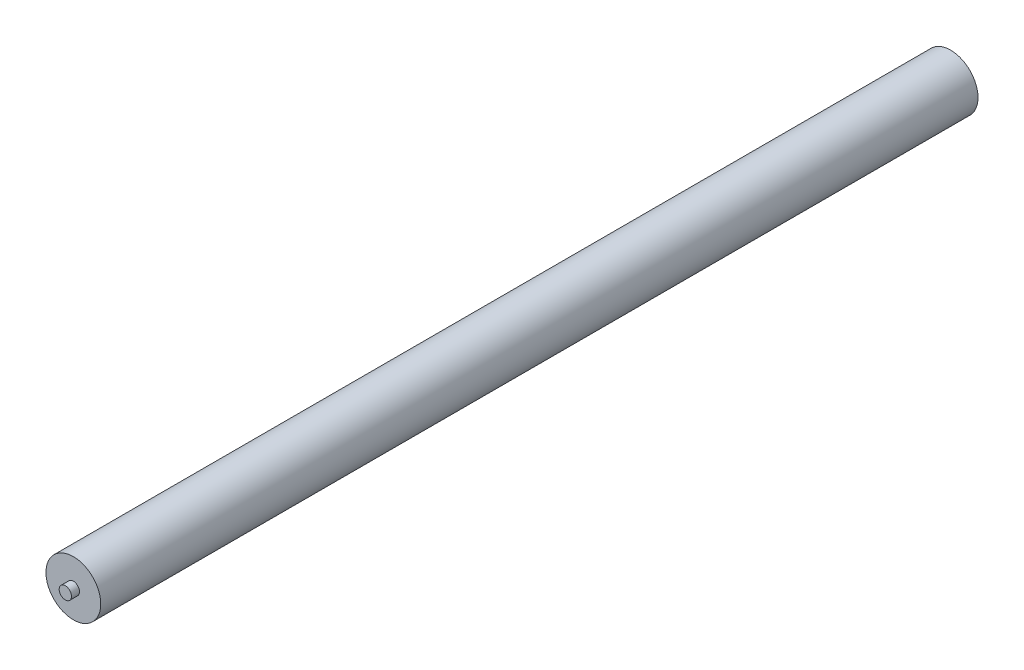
ISO-10303-21;
HEADER;
FILE_DESCRIPTION(('STEP AP214'),'2;1');
FILE_NAME('part.step','',(''),(''),'','','');
FILE_SCHEMA(('AUTOMOTIVE_DESIGN { 1 0 10303 214 1 1 1 1 }'));
ENDSEC;
DATA;
#1=APPLICATION_CONTEXT('core data for automotive mechanical design processes');
#2=APPLICATION_PROTOCOL_DEFINITION('international standard','automotive_design',2000,#1);
#3=PRODUCT_CONTEXT('',#1,'mechanical');
#4=PRODUCT('Part','Part','',(#3));
#5=PRODUCT_RELATED_PRODUCT_CATEGORY('part','',(#4));
#6=PRODUCT_DEFINITION_FORMATION('','',#4);
#7=PRODUCT_DEFINITION_CONTEXT('part definition',#1,'design');
#8=PRODUCT_DEFINITION('design','',#6,#7);
#9=PRODUCT_DEFINITION_SHAPE('','',#8);
#10=(LENGTH_UNIT() NAMED_UNIT(*) SI_UNIT(.MILLI.,.METRE.));
#11=(NAMED_UNIT(*) PLANE_ANGLE_UNIT() SI_UNIT($,.RADIAN.));
#12=(NAMED_UNIT(*) SI_UNIT($,.STERADIAN.) SOLID_ANGLE_UNIT());
#13=UNCERTAINTY_MEASURE_WITH_UNIT(LENGTH_MEASURE(1.E-05),#10,'distance_accuracy_value','');
#14=(GEOMETRIC_REPRESENTATION_CONTEXT(3) GLOBAL_UNCERTAINTY_ASSIGNED_CONTEXT((#13)) GLOBAL_UNIT_ASSIGNED_CONTEXT((#10,
#11,#12)) REPRESENTATION_CONTEXT('',''));
#15=CARTESIAN_POINT('',(0.,0.,0.));
#16=DIRECTION('',(0.,0.,1.));
#17=DIRECTION('',(1.,0.,0.));
#18=AXIS2_PLACEMENT_3D('',#15,#16,#17);
#19=CARTESIAN_POINT('',(0.,0.,0.));
#20=DIRECTION('',(0.,0.,1.));
#21=DIRECTION('',(1.,0.,0.));
#22=AXIS2_PLACEMENT_3D('',#19,#20,#21);
#23=PLANE('',#22);
#24=CARTESIAN_POINT('',(0.,0.,0.));
#25=DIRECTION('',(0.,0.,1.));
#26=DIRECTION('',(1.,0.,0.));
#27=AXIS2_PLACEMENT_3D('',#24,#25,#26);
#28=CIRCLE('',#27,44.5);
#29=CARTESIAN_POINT('',(44.5,0.,0.));
#30=VERTEX_POINT('',#29);
#31=EDGE_CURVE('E41',#30,#30,#28,.T.);
#32=ORIENTED_EDGE('',*,*,#31,.F.);
#33=EDGE_LOOP('',(#32));
#34=FACE_BOUND('',#33,.T.);
#35=CARTESIAN_POINT('',(0.,0.,0.));
#36=DIRECTION('',(0.,0.,1.));
#37=DIRECTION('',(1.,0.,0.));
#38=AXIS2_PLACEMENT_3D('',#35,#36,#37);
#39=CIRCLE('',#38,10.);
#40=CARTESIAN_POINT('',(10.,0.,0.));
#41=VERTEX_POINT('',#40);
#42=EDGE_CURVE('E10',#41,#41,#39,.F.);
#43=ORIENTED_EDGE('',*,*,#42,.F.);
#44=EDGE_LOOP('',(#43));
#45=FACE_BOUND('',#44,.T.);
#46=ADVANCED_FACE('F30',(#34,#45),#23,.F.);
#47=CARTESIAN_POINT('',(0.,0.,1425.));
#48=DIRECTION('',(0.,0.,1.));
#49=DIRECTION('',(1.,0.,0.));
#50=AXIS2_PLACEMENT_3D('',#47,#48,#49);
#51=PLANE('',#50);
#52=CARTESIAN_POINT('',(0.,0.,1425.));
#53=DIRECTION('',(0.,0.,1.));
#54=DIRECTION('',(1.,0.,0.));
#55=AXIS2_PLACEMENT_3D('',#52,#53,#54);
#56=CIRCLE('',#55,44.5);
#57=CARTESIAN_POINT('',(44.5,0.,1425.));
#58=VERTEX_POINT('',#57);
#59=EDGE_CURVE('E37',#58,#58,#56,.T.);
#60=ORIENTED_EDGE('',*,*,#59,.T.);
#61=EDGE_LOOP('',(#60));
#62=FACE_BOUND('',#61,.T.);
#63=CARTESIAN_POINT('',(0.,0.,1425.));
#64=DIRECTION('',(0.,0.,1.));
#65=DIRECTION('',(1.,0.,0.));
#66=AXIS2_PLACEMENT_3D('',#63,#64,#65);
#67=CIRCLE('',#66,10.);
#68=CARTESIAN_POINT('',(-10.,0.,1425.));
#69=VERTEX_POINT('',#68);
#70=EDGE_CURVE('E50',#69,#69,#67,.T.);
#71=ORIENTED_EDGE('',*,*,#70,.F.);
#72=EDGE_LOOP('',(#71));
#73=FACE_BOUND('',#72,.T.);
#74=ADVANCED_FACE('F72',(#62,#73),#51,.T.);
#75=CARTESIAN_POINT('',(0.,0.,1425.));
#76=DIRECTION('',(0.,0.,-1.));
#77=DIRECTION('',(-1.,0.,0.));
#78=AXIS2_PLACEMENT_3D('',#75,#76,#77);
#79=CYLINDRICAL_SURFACE('',#78,44.5);
#80=ORIENTED_EDGE('',*,*,#59,.F.);
#81=EDGE_LOOP('',(#80));
#82=FACE_BOUND('',#81,.T.);
#83=ORIENTED_EDGE('',*,*,#31,.T.);
#84=EDGE_LOOP('',(#83));
#85=FACE_BOUND('',#84,.T.);
#86=ADVANCED_FACE('F32',(#82,#85),#79,.T.);
#87=CARTESIAN_POINT('',(0.,0.,1438.));
#88=DIRECTION('',(0.,0.,-1.));
#89=DIRECTION('',(-1.,0.,0.));
#90=AXIS2_PLACEMENT_3D('',#87,#88,#89);
#91=CYLINDRICAL_SURFACE('',#90,10.);
#92=CARTESIAN_POINT('',(0.,0.,1438.));
#93=DIRECTION('',(0.,0.,1.));
#94=DIRECTION('',(1.,0.,0.));
#95=AXIS2_PLACEMENT_3D('',#92,#93,#94);
#96=CIRCLE('',#95,10.);
#97=CARTESIAN_POINT('',(-10.,0.,1438.));
#98=VERTEX_POINT('',#97);
#99=EDGE_CURVE('E45',#98,#98,#96,.T.);
#100=CARTESIAN_POINT('',(-10.,0.,1438.));
#101=CARTESIAN_POINT('',(-10.,0.,1437.86458333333));
#102=CARTESIAN_POINT('',(-10.,0.,1437.72916666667));
#103=CARTESIAN_POINT('',(-10.,0.,1437.45833333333));
#104=CARTESIAN_POINT('',(-10.,0.,1437.32291666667));
#105=CARTESIAN_POINT('',(-10.,0.,1437.05208333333));
#106=CARTESIAN_POINT('',(-10.,0.,1436.91666666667));
#107=CARTESIAN_POINT('',(-10.,0.,1436.64583333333));
#108=CARTESIAN_POINT('',(-10.,0.,1436.51041666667));
#109=CARTESIAN_POINT('',(-10.,0.,1436.23958333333));
#110=CARTESIAN_POINT('',(-10.,0.,1436.10416666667));
#111=CARTESIAN_POINT('',(-10.,0.,1435.83333333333));
#112=CARTESIAN_POINT('',(-10.,0.,1435.69791666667));
#113=CARTESIAN_POINT('',(-10.,0.,1435.42708333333));
#114=CARTESIAN_POINT('',(-10.,0.,1435.29166666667));
#115=CARTESIAN_POINT('',(-10.,0.,1435.02083333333));
#116=CARTESIAN_POINT('',(-10.,0.,1434.88541666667));
#117=CARTESIAN_POINT('',(-10.,0.,1434.61458333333));
#118=CARTESIAN_POINT('',(-10.,0.,1434.47916666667));
#119=CARTESIAN_POINT('',(-10.,0.,1434.20833333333));
#120=CARTESIAN_POINT('',(-10.,0.,1434.07291666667));
#121=CARTESIAN_POINT('',(-10.,0.,1433.80208333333));
#122=CARTESIAN_POINT('',(-10.,0.,1433.66666666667));
#123=CARTESIAN_POINT('',(-10.,0.,1433.39583333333));
#124=CARTESIAN_POINT('',(-10.,0.,1433.26041666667));
#125=CARTESIAN_POINT('',(-10.,0.,1432.98958333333));
#126=CARTESIAN_POINT('',(-10.,0.,1432.85416666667));
#127=CARTESIAN_POINT('',(-10.,0.,1432.58333333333));
#128=CARTESIAN_POINT('',(-10.,0.,1432.44791666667));
#129=CARTESIAN_POINT('',(-10.,0.,1432.17708333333));
#130=CARTESIAN_POINT('',(-10.,0.,1432.04166666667));
#131=CARTESIAN_POINT('',(-10.,0.,1431.77083333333));
#132=CARTESIAN_POINT('',(-10.,0.,1431.63541666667));
#133=CARTESIAN_POINT('',(-10.,0.,1431.36458333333));
#134=CARTESIAN_POINT('',(-10.,0.,1431.22916666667));
#135=CARTESIAN_POINT('',(-10.,0.,1430.95833333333));
#136=CARTESIAN_POINT('',(-10.,0.,1430.82291666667));
#137=CARTESIAN_POINT('',(-10.,0.,1430.55208333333));
#138=CARTESIAN_POINT('',(-10.,0.,1430.41666666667));
#139=CARTESIAN_POINT('',(-10.,0.,1430.14583333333));
#140=CARTESIAN_POINT('',(-10.,0.,1430.01041666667));
#141=CARTESIAN_POINT('',(-10.,0.,1429.73958333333));
#142=CARTESIAN_POINT('',(-10.,0.,1429.60416666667));
#143=CARTESIAN_POINT('',(-10.,0.,1429.33333333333));
#144=CARTESIAN_POINT('',(-10.,0.,1429.19791666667));
#145=CARTESIAN_POINT('',(-10.,0.,1428.92708333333));
#146=CARTESIAN_POINT('',(-10.,0.,1428.79166666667));
#147=CARTESIAN_POINT('',(-10.,0.,1428.52083333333));
#148=CARTESIAN_POINT('',(-10.,0.,1428.38541666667));
#149=CARTESIAN_POINT('',(-10.,0.,1428.11458333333));
#150=CARTESIAN_POINT('',(-10.,0.,1427.97916666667));
#151=CARTESIAN_POINT('',(-10.,0.,1427.70833333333));
#152=CARTESIAN_POINT('',(-10.,0.,1427.57291666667));
#153=CARTESIAN_POINT('',(-10.,0.,1427.30208333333));
#154=CARTESIAN_POINT('',(-10.,0.,1427.16666666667));
#155=CARTESIAN_POINT('',(-10.,0.,1426.89583333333));
#156=CARTESIAN_POINT('',(-10.,0.,1426.76041666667));
#157=CARTESIAN_POINT('',(-10.,0.,1426.48958333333));
#158=CARTESIAN_POINT('',(-10.,0.,1426.35416666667));
#159=CARTESIAN_POINT('',(-10.,0.,1426.08333333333));
#160=CARTESIAN_POINT('',(-10.,0.,1425.94791666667));
#161=CARTESIAN_POINT('',(-10.,0.,1425.67708333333));
#162=CARTESIAN_POINT('',(-10.,0.,1425.54166666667));
#163=CARTESIAN_POINT('',(-10.,0.,1425.27083333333));
#164=CARTESIAN_POINT('',(-10.,0.,1425.13541666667));
#165=CARTESIAN_POINT('',(-10.,0.,1425.));
#166=B_SPLINE_CURVE_WITH_KNOTS('',3,(#100,#101,#102,#103,#104,#105,#106,#107,#108,#109,#110,
#111,#112,#113,#114,#115,#116,#117,#118,#119,#120,#121,#122,#123,#124,#125,#126,#127,#128,#129,
#130,#131,#132,#133,#134,#135,#136,#137,#138,#139,#140,#141,#142,#143,#144,#145,#146,#147,#148,
#149,#150,#151,#152,#153,#154,#155,#156,#157,#158,#159,#160,#161,#162,#163,#164,#165),
.UNSPECIFIED.,.F.,.F.,(4,2,2,2,2,2,2,2,2,2,2,2,2,2,2,2,2,2,2,2,2,2,2,2,2,2,2,2,2,2,2,2,4),(0.,
0.406250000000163,0.812500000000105,1.21875000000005,1.62499999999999,2.03125000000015,
2.43750000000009,2.84375000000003,3.24999999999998,3.65625000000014,4.06250000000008,
4.46875000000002,4.87499999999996,5.28125000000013,5.68750000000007,6.09375000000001,
6.49999999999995,6.90625000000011,7.31250000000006,7.71875,8.12499999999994,8.5312500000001,
8.93750000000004,9.34374999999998,9.74999999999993,10.1562500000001,10.5625,10.96875,
11.3749999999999,11.7812500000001,12.1875,12.59375,12.9999999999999),.UNSPECIFIED.);
#167=EDGE_CURVE('BSEAM68',#98,#69,#166,.T.);
#168=ORIENTED_EDGE('',*,*,#99,.F.);
#169=ORIENTED_EDGE('',*,*,#70,.T.);
#170=ORIENTED_EDGE('',*,*,#167,.T.);
#171=ORIENTED_EDGE('',*,*,#167,.F.);
#172=EDGE_LOOP('',(#168,#170,#169,#171));
#173=FACE_BOUND('',#172,.T.);
#174=ADVANCED_FACE('F68',(#173),#91,.T.);
#175=CARTESIAN_POINT('',(0.,0.,1438.));
#176=DIRECTION('',(0.,0.,1.));
#177=DIRECTION('',(1.,0.,0.));
#178=AXIS2_PLACEMENT_3D('',#175,#176,#177);
#179=PLANE('',#178);
#180=ORIENTED_EDGE('',*,*,#99,.T.);
#181=EDGE_LOOP('',(#180));
#182=FACE_BOUND('',#181,.T.);
#183=ADVANCED_FACE('F61',(#182),#179,.T.);
#184=CARTESIAN_POINT('',(0.,0.,-13.));
#185=DIRECTION('',(0.,0.,1.));
#186=DIRECTION('',(1.,0.,0.));
#187=AXIS2_PLACEMENT_3D('',#184,#185,#186);
#188=CYLINDRICAL_SURFACE('',#187,10.);
#189=CARTESIAN_POINT('',(0.,0.,-13.));
#190=DIRECTION('',(0.,0.,-1.));
#191=DIRECTION('',(-1.,0.,0.));
#192=AXIS2_PLACEMENT_3D('',#189,#190,#191);
#193=CIRCLE('',#192,10.);
#194=CARTESIAN_POINT('',(10.,0.,-13.));
#195=VERTEX_POINT('',#194);
#196=EDGE_CURVE('E53',#195,#195,#193,.T.);
#197=CARTESIAN_POINT('',(10.,0.,-13.));
#198=CARTESIAN_POINT('',(10.,0.,-12.8645833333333));
#199=CARTESIAN_POINT('',(10.,0.,-12.7291666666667));
#200=CARTESIAN_POINT('',(10.,0.,-12.4583333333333));
#201=CARTESIAN_POINT('',(10.,0.,-12.3229166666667));
#202=CARTESIAN_POINT('',(10.,0.,-12.0520833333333));
#203=CARTESIAN_POINT('',(10.,0.,-11.9166666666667));
#204=CARTESIAN_POINT('',(10.,0.,-11.6458333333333));
#205=CARTESIAN_POINT('',(10.,0.,-11.5104166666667));
#206=CARTESIAN_POINT('',(10.,0.,-11.2395833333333));
#207=CARTESIAN_POINT('',(10.,0.,-11.1041666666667));
#208=CARTESIAN_POINT('',(10.,0.,-10.8333333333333));
#209=CARTESIAN_POINT('',(10.,0.,-10.6979166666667));
#210=CARTESIAN_POINT('',(10.,0.,-10.4270833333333));
#211=CARTESIAN_POINT('',(10.,0.,-10.2916666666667));
#212=CARTESIAN_POINT('',(10.,0.,-10.0208333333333));
#213=CARTESIAN_POINT('',(10.,0.,-9.88541666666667));
#214=CARTESIAN_POINT('',(10.,0.,-9.61458333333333));
#215=CARTESIAN_POINT('',(10.,0.,-9.47916666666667));
#216=CARTESIAN_POINT('',(10.,0.,-9.20833333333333));
#217=CARTESIAN_POINT('',(10.,0.,-9.07291666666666));
#218=CARTESIAN_POINT('',(10.,0.,-8.80208333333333));
#219=CARTESIAN_POINT('',(10.,0.,-8.66666666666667));
#220=CARTESIAN_POINT('',(10.,0.,-8.39583333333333));
#221=CARTESIAN_POINT('',(10.,0.,-8.26041666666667));
#222=CARTESIAN_POINT('',(10.,0.,-7.98958333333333));
#223=CARTESIAN_POINT('',(10.,0.,-7.85416666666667));
#224=CARTESIAN_POINT('',(10.,0.,-7.58333333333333));
#225=CARTESIAN_POINT('',(10.,0.,-7.44791666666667));
#226=CARTESIAN_POINT('',(10.,0.,-7.17708333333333));
#227=CARTESIAN_POINT('',(10.,0.,-7.04166666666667));
#228=CARTESIAN_POINT('',(10.,0.,-6.77083333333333));
#229=CARTESIAN_POINT('',(10.,0.,-6.63541666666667));
#230=CARTESIAN_POINT('',(10.,0.,-6.36458333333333));
#231=CARTESIAN_POINT('',(10.,0.,-6.22916666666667));
#232=CARTESIAN_POINT('',(10.,0.,-5.95833333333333));
#233=CARTESIAN_POINT('',(10.,0.,-5.82291666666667));
#234=CARTESIAN_POINT('',(10.,0.,-5.55208333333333));
#235=CARTESIAN_POINT('',(10.,0.,-5.41666666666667));
#236=CARTESIAN_POINT('',(10.,0.,-5.14583333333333));
#237=CARTESIAN_POINT('',(10.,0.,-5.01041666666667));
#238=CARTESIAN_POINT('',(10.,0.,-4.73958333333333));
#239=CARTESIAN_POINT('',(10.,0.,-4.60416666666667));
#240=CARTESIAN_POINT('',(10.,0.,-4.33333333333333));
#241=CARTESIAN_POINT('',(10.,0.,-4.19791666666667));
#242=CARTESIAN_POINT('',(10.,0.,-3.92708333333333));
#243=CARTESIAN_POINT('',(10.,0.,-3.79166666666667));
#244=CARTESIAN_POINT('',(10.,0.,-3.52083333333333));
#245=CARTESIAN_POINT('',(10.,0.,-3.38541666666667));
#246=CARTESIAN_POINT('',(10.,0.,-3.11458333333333));
#247=CARTESIAN_POINT('',(10.,0.,-2.97916666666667));
#248=CARTESIAN_POINT('',(10.,0.,-2.70833333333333));
#249=CARTESIAN_POINT('',(10.,0.,-2.57291666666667));
#250=CARTESIAN_POINT('',(10.,0.,-2.30208333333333));
#251=CARTESIAN_POINT('',(10.,0.,-2.16666666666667));
#252=CARTESIAN_POINT('',(10.,0.,-1.89583333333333));
#253=CARTESIAN_POINT('',(10.,0.,-1.76041666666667));
#254=CARTESIAN_POINT('',(10.,0.,-1.48958333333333));
#255=CARTESIAN_POINT('',(10.,0.,-1.35416666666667));
#256=CARTESIAN_POINT('',(10.,0.,-1.08333333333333));
#257=CARTESIAN_POINT('',(10.,0.,-0.947916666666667));
#258=CARTESIAN_POINT('',(10.,0.,-0.677083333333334));
#259=CARTESIAN_POINT('',(10.,0.,-0.541666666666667));
#260=CARTESIAN_POINT('',(10.,0.,-0.270833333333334));
#261=CARTESIAN_POINT('',(10.,0.,-0.135416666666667));
#262=CARTESIAN_POINT('',(10.,0.,0.));
#263=B_SPLINE_CURVE_WITH_KNOTS('',3,(#197,#198,#199,#200,#201,#202,#203,#204,#205,#206,#207,
#208,#209,#210,#211,#212,#213,#214,#215,#216,#217,#218,#219,#220,#221,#222,#223,#224,#225,#226,
#227,#228,#229,#230,#231,#232,#233,#234,#235,#236,#237,#238,#239,#240,#241,#242,#243,#244,#245,
#246,#247,#248,#249,#250,#251,#252,#253,#254,#255,#256,#257,#258,#259,#260,#261,#262),
.UNSPECIFIED.,.F.,.F.,(4,2,2,2,2,2,2,2,2,2,2,2,2,2,2,2,2,2,2,2,2,2,2,2,2,2,2,2,2,2,2,2,4),(0.,
0.40625,0.812500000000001,1.21875,1.625,2.03125,2.4375,2.84375,3.25,3.65625,4.0625,4.46875,
4.875,5.28125,5.6875,6.09375,6.5,6.90625,7.3125,7.71875,8.125,8.53125,8.9375,9.34375,9.75,
10.15625,10.5625,10.96875,11.375,11.78125,12.1875,12.59375,13.),.UNSPECIFIED.);
#264=EDGE_CURVE('BSEAM59',#195,#41,#263,.T.);
#265=ORIENTED_EDGE('',*,*,#196,.F.);
#266=ORIENTED_EDGE('',*,*,#42,.T.);
#267=ORIENTED_EDGE('',*,*,#264,.T.);
#268=ORIENTED_EDGE('',*,*,#264,.F.);
#269=EDGE_LOOP('',(#265,#267,#266,#268));
#270=FACE_BOUND('',#269,.T.);
#271=ADVANCED_FACE('F59',(#270),#188,.T.);
#272=CARTESIAN_POINT('',(0.,0.,-13.));
#273=DIRECTION('',(0.,0.,-1.));
#274=DIRECTION('',(-1.,0.,0.));
#275=AXIS2_PLACEMENT_3D('',#272,#273,#274);
#276=PLANE('',#275);
#277=ORIENTED_EDGE('',*,*,#196,.T.);
#278=EDGE_LOOP('',(#277));
#279=FACE_BOUND('',#278,.T.);
#280=ADVANCED_FACE('F57',(#279),#276,.T.);
#281=CLOSED_SHELL('',(#46,#74,#86,#174,#183,#271,#280));
#282=MANIFOLD_SOLID_BREP('B2',#281);
#283=ADVANCED_BREP_SHAPE_REPRESENTATION('',(#18,#282),#14);
#284=SHAPE_DEFINITION_REPRESENTATION(#9,#283);
ENDSEC;
END-ISO-10303-21;
